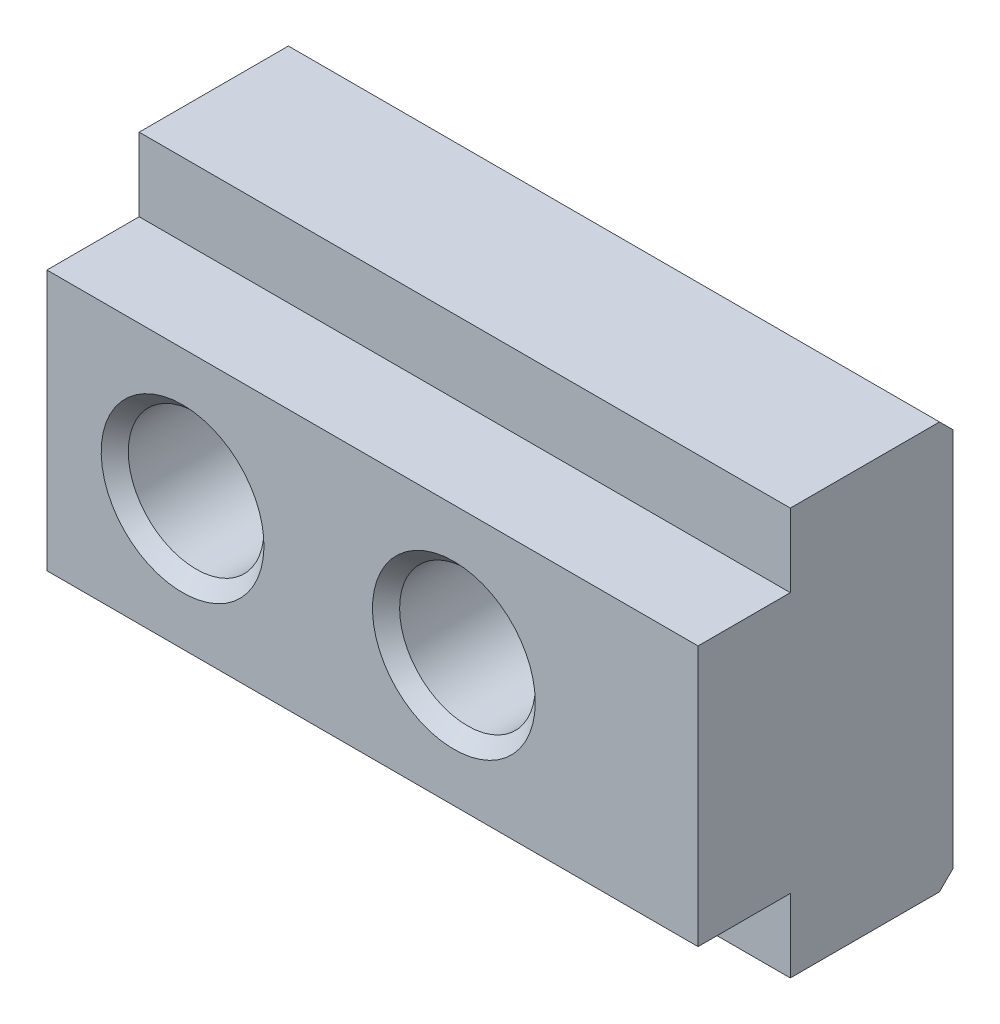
ISO-10303-21;
HEADER;
FILE_DESCRIPTION(('STEP AP214'),'2;1');
FILE_NAME('part.step','',(''),(''),'','','');
FILE_SCHEMA(('AUTOMOTIVE_DESIGN { 1 0 10303 214 1 1 1 1 }'));
ENDSEC;
DATA;
#1=APPLICATION_CONTEXT('core data for automotive mechanical design processes');
#2=APPLICATION_PROTOCOL_DEFINITION('international standard','automotive_design',2000,#1);
#3=PRODUCT_CONTEXT('',#1,'mechanical');
#4=PRODUCT('Part','Part','',(#3));
#5=PRODUCT_RELATED_PRODUCT_CATEGORY('part','',(#4));
#6=PRODUCT_DEFINITION_FORMATION('','',#4);
#7=PRODUCT_DEFINITION_CONTEXT('part definition',#1,'design');
#8=PRODUCT_DEFINITION('design','',#6,#7);
#9=PRODUCT_DEFINITION_SHAPE('','',#8);
#10=(LENGTH_UNIT() NAMED_UNIT(*) SI_UNIT(.MILLI.,.METRE.));
#11=(NAMED_UNIT(*) PLANE_ANGLE_UNIT() SI_UNIT($,.RADIAN.));
#12=(NAMED_UNIT(*) SI_UNIT($,.STERADIAN.) SOLID_ANGLE_UNIT());
#13=UNCERTAINTY_MEASURE_WITH_UNIT(LENGTH_MEASURE(1.E-05),#10,'distance_accuracy_value','');
#14=(GEOMETRIC_REPRESENTATION_CONTEXT(3) GLOBAL_UNCERTAINTY_ASSIGNED_CONTEXT((#13)) GLOBAL_UNIT_ASSIGNED_CONTEXT((#10,
#11,#12)) REPRESENTATION_CONTEXT('',''));
#15=CARTESIAN_POINT('',(0.,0.,0.));
#16=DIRECTION('',(0.,0.,1.));
#17=DIRECTION('',(1.,0.,0.));
#18=AXIS2_PLACEMENT_3D('',#15,#16,#17);
#19=CARTESIAN_POINT('',(-5.,7.5,0.));
#20=DIRECTION('',(0.,-1.,0.));
#21=DIRECTION('',(-1.,0.,0.));
#22=AXIS2_PLACEMENT_3D('',#19,#20,#21);
#23=PLANE('',#22);
#24=DIRECTION('',(-1.,0.,0.));
#25=VECTOR('',#24,1.);
#26=CARTESIAN_POINT('',(-5.,7.5,0.));
#27=LINE('',#26,#25);
#28=CARTESIAN_POINT('',(-5.,7.5,0.));
#29=VERTEX_POINT('',#28);
#30=CARTESIAN_POINT('',(19.,7.5,0.));
#31=VERTEX_POINT('',#30);
#32=EDGE_CURVE('E62',#29,#31,#27,.F.);
#33=ORIENTED_EDGE('',*,*,#32,.T.);
#34=DIRECTION('',(0.,0.,1.));
#35=VECTOR('',#34,1.);
#36=CARTESIAN_POINT('',(19.,7.5,-5.5));
#37=LINE('',#36,#35);
#38=CARTESIAN_POINT('',(19.,7.5,-5.5));
#39=VERTEX_POINT('',#38);
#40=EDGE_CURVE('E137',#39,#31,#37,.T.);
#41=ORIENTED_EDGE('',*,*,#40,.F.);
#42=DIRECTION('',(-1.,0.,0.));
#43=VECTOR('',#42,1.);
#44=CARTESIAN_POINT('',(-5.,7.5,-5.5));
#45=LINE('',#44,#43);
#46=CARTESIAN_POINT('',(-5.,7.5,-5.5));
#47=VERTEX_POINT('',#46);
#48=EDGE_CURVE('E175',#39,#47,#45,.T.);
#49=ORIENTED_EDGE('',*,*,#48,.T.);
#50=DIRECTION('',(0.,0.,-1.));
#51=VECTOR('',#50,1.);
#52=CARTESIAN_POINT('',(-5.,7.5,3.4));
#53=LINE('',#52,#51);
#54=EDGE_CURVE('E172',#29,#47,#53,.T.);
#55=ORIENTED_EDGE('',*,*,#54,.F.);
#56=EDGE_LOOP('',(#33,#41,#49,#55));
#57=FACE_BOUND('',#56,.T.);
#58=ADVANCED_FACE('F14',(#57),#23,.F.);
#59=CARTESIAN_POINT('',(-5.,-7.5,0.));
#60=DIRECTION('',(0.,1.,0.));
#61=DIRECTION('',(1.,0.,0.));
#62=AXIS2_PLACEMENT_3D('',#59,#60,#61);
#63=PLANE('',#62);
#64=DIRECTION('',(-1.,0.,0.));
#65=VECTOR('',#64,1.);
#66=CARTESIAN_POINT('',(-5.,-7.5,-5.5));
#67=LINE('',#66,#65);
#68=CARTESIAN_POINT('',(-5.,-7.5,-5.5));
#69=VERTEX_POINT('',#68);
#70=CARTESIAN_POINT('',(19.,-7.5,-5.5));
#71=VERTEX_POINT('',#70);
#72=EDGE_CURVE('E177',#69,#71,#67,.F.);
#73=ORIENTED_EDGE('',*,*,#72,.T.);
#74=DIRECTION('',(0.,0.,-1.));
#75=VECTOR('',#74,1.);
#76=CARTESIAN_POINT('',(19.,-7.5,0.));
#77=LINE('',#76,#75);
#78=CARTESIAN_POINT('',(19.,-7.5,0.));
#79=VERTEX_POINT('',#78);
#80=EDGE_CURVE('E121',#79,#71,#77,.T.);
#81=ORIENTED_EDGE('',*,*,#80,.F.);
#82=DIRECTION('',(-1.,0.,0.));
#83=VECTOR('',#82,1.);
#84=CARTESIAN_POINT('',(-5.,-7.5,0.));
#85=LINE('',#84,#83);
#86=CARTESIAN_POINT('',(-5.,-7.5,0.));
#87=VERTEX_POINT('',#86);
#88=EDGE_CURVE('E113',#79,#87,#85,.T.);
#89=ORIENTED_EDGE('',*,*,#88,.T.);
#90=DIRECTION('',(0.,0.,-1.));
#91=VECTOR('',#90,1.);
#92=CARTESIAN_POINT('',(-5.,-7.5,3.4));
#93=LINE('',#92,#91);
#94=EDGE_CURVE('E164',#69,#87,#93,.F.);
#95=ORIENTED_EDGE('',*,*,#94,.F.);
#96=EDGE_LOOP('',(#73,#81,#89,#95));
#97=FACE_BOUND('',#96,.T.);
#98=ADVANCED_FACE('F261',(#97),#63,.F.);
#99=CARTESIAN_POINT('',(-5.,-4.8,0.));
#100=DIRECTION('',(0.,0.,-1.));
#101=DIRECTION('',(-1.,0.,0.));
#102=AXIS2_PLACEMENT_3D('',#99,#100,#101);
#103=PLANE('',#102);
#104=ORIENTED_EDGE('',*,*,#88,.F.);
#105=DIRECTION('',(0.,-1.,0.));
#106=VECTOR('',#105,1.);
#107=CARTESIAN_POINT('',(19.,-4.8,0.));
#108=LINE('',#107,#106);
#109=CARTESIAN_POINT('',(19.,-4.8,0.));
#110=VERTEX_POINT('',#109);
#111=EDGE_CURVE('E116',#110,#79,#108,.T.);
#112=ORIENTED_EDGE('',*,*,#111,.F.);
#113=DIRECTION('',(1.,0.,0.));
#114=VECTOR('',#113,1.);
#115=CARTESIAN_POINT('',(-5.,-4.8,0.));
#116=LINE('',#115,#114);
#117=CARTESIAN_POINT('',(-5.,-4.8,0.));
#118=VERTEX_POINT('',#117);
#119=EDGE_CURVE('E103',#110,#118,#116,.F.);
#120=ORIENTED_EDGE('',*,*,#119,.T.);
#121=DIRECTION('',(0.,1.,0.));
#122=VECTOR('',#121,1.);
#123=CARTESIAN_POINT('',(-5.,-4.8,0.));
#124=LINE('',#123,#122);
#125=EDGE_CURVE('E162',#87,#118,#124,.T.);
#126=ORIENTED_EDGE('',*,*,#125,.F.);
#127=EDGE_LOOP('',(#104,#112,#120,#126));
#128=FACE_BOUND('',#127,.T.);
#129=ADVANCED_FACE('F117',(#128),#103,.F.);
#130=CARTESIAN_POINT('',(-5.,-4.8,3.4));
#131=DIRECTION('',(0.,1.,0.));
#132=DIRECTION('',(1.,0.,0.));
#133=AXIS2_PLACEMENT_3D('',#130,#131,#132);
#134=PLANE('',#133);
#135=ORIENTED_EDGE('',*,*,#119,.F.);
#136=DIRECTION('',(0.,0.,-1.));
#137=VECTOR('',#136,1.);
#138=CARTESIAN_POINT('',(19.,-4.8,3.4));
#139=LINE('',#138,#137);
#140=CARTESIAN_POINT('',(19.,-4.8,3.4));
#141=VERTEX_POINT('',#140);
#142=EDGE_CURVE('E107',#141,#110,#139,.T.);
#143=ORIENTED_EDGE('',*,*,#142,.F.);
#144=DIRECTION('',(-1.,0.,0.));
#145=VECTOR('',#144,1.);
#146=CARTESIAN_POINT('',(-5.,-4.8,3.4));
#147=LINE('',#146,#145);
#148=CARTESIAN_POINT('',(-5.,-4.8,3.4));
#149=VERTEX_POINT('',#148);
#150=EDGE_CURVE('E70',#141,#149,#147,.T.);
#151=ORIENTED_EDGE('',*,*,#150,.T.);
#152=DIRECTION('',(0.,0.,-1.));
#153=VECTOR('',#152,1.);
#154=CARTESIAN_POINT('',(-5.,-4.8,3.4));
#155=LINE('',#154,#153);
#156=EDGE_CURVE('E109',#118,#149,#155,.F.);
#157=ORIENTED_EDGE('',*,*,#156,.F.);
#158=EDGE_LOOP('',(#135,#143,#151,#157));
#159=FACE_BOUND('',#158,.T.);
#160=ADVANCED_FACE('F105',(#159),#134,.F.);
#161=CARTESIAN_POINT('',(-5.,-4.8,3.4));
#162=DIRECTION('',(0.,0.,-1.));
#163=DIRECTION('',(-1.,0.,0.));
#164=AXIS2_PLACEMENT_3D('',#161,#162,#163);
#165=PLANE('',#164);
#166=CARTESIAN_POINT('',(10.,0.,3.4));
#167=DIRECTION('',(0.,0.,-1.));
#168=DIRECTION('',(0.,1.,0.));
#169=AXIS2_PLACEMENT_3D('',#166,#167,#168);
#170=CIRCLE('',#169,3.);
#171=CARTESIAN_POINT('',(10.,3.,3.4));
#172=VERTEX_POINT('',#171);
#173=EDGE_CURVE('E199',#172,#172,#170,.T.);
#174=ORIENTED_EDGE('',*,*,#173,.T.);
#175=EDGE_LOOP('',(#174));
#176=FACE_BOUND('',#175,.T.);
#177=CARTESIAN_POINT('',(0.,0.,3.4));
#178=DIRECTION('',(0.,0.,-1.));
#179=DIRECTION('',(0.,1.,0.));
#180=AXIS2_PLACEMENT_3D('',#177,#178,#179);
#181=CIRCLE('',#180,2.99999999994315);
#182=CARTESIAN_POINT('',(0.,2.99999999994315,3.4));
#183=VERTEX_POINT('',#182);
#184=EDGE_CURVE('E196',#183,#183,#181,.T.);
#185=ORIENTED_EDGE('',*,*,#184,.T.);
#186=EDGE_LOOP('',(#185));
#187=FACE_BOUND('',#186,.T.);
#188=ORIENTED_EDGE('',*,*,#150,.F.);
#189=DIRECTION('',(0.,-1.,0.));
#190=VECTOR('',#189,1.);
#191=CARTESIAN_POINT('',(19.,4.8,3.4));
#192=LINE('',#191,#190);
#193=CARTESIAN_POINT('',(19.,4.8,3.4));
#194=VERTEX_POINT('',#193);
#195=EDGE_CURVE('E124',#194,#141,#192,.T.);
#196=ORIENTED_EDGE('',*,*,#195,.F.);
#197=DIRECTION('',(-1.,0.,0.));
#198=VECTOR('',#197,1.);
#199=CARTESIAN_POINT('',(-5.,4.8,3.4));
#200=LINE('',#199,#198);
#201=CARTESIAN_POINT('',(-5.,4.8,3.4));
#202=VERTEX_POINT('',#201);
#203=EDGE_CURVE('E77',#194,#202,#200,.T.);
#204=ORIENTED_EDGE('',*,*,#203,.T.);
#205=DIRECTION('',(0.,1.,0.));
#206=VECTOR('',#205,1.);
#207=CARTESIAN_POINT('',(-5.,-4.8,3.4));
#208=LINE('',#207,#206);
#209=EDGE_CURVE('E158',#149,#202,#208,.T.);
#210=ORIENTED_EDGE('',*,*,#209,.F.);
#211=EDGE_LOOP('',(#188,#196,#204,#210));
#212=FACE_BOUND('',#211,.T.);
#213=ADVANCED_FACE('F211',(#176,#187,#212),#165,.F.);
#214=CARTESIAN_POINT('',(-5.,4.8,3.4));
#215=DIRECTION('',(0.,-1.,0.));
#216=DIRECTION('',(-1.,0.,0.));
#217=AXIS2_PLACEMENT_3D('',#214,#215,#216);
#218=PLANE('',#217);
#219=ORIENTED_EDGE('',*,*,#203,.F.);
#220=DIRECTION('',(0.,0.,1.));
#221=VECTOR('',#220,1.);
#222=CARTESIAN_POINT('',(19.,4.8,0.));
#223=LINE('',#222,#221);
#224=CARTESIAN_POINT('',(19.,4.8,0.));
#225=VERTEX_POINT('',#224);
#226=EDGE_CURVE('E143',#225,#194,#223,.T.);
#227=ORIENTED_EDGE('',*,*,#226,.F.);
#228=DIRECTION('',(-1.,0.,0.));
#229=VECTOR('',#228,1.);
#230=CARTESIAN_POINT('',(-5.,4.8,0.));
#231=LINE('',#230,#229);
#232=CARTESIAN_POINT('',(-5.,4.8,0.));
#233=VERTEX_POINT('',#232);
#234=EDGE_CURVE('E180',#225,#233,#231,.T.);
#235=ORIENTED_EDGE('',*,*,#234,.T.);
#236=DIRECTION('',(0.,0.,-1.));
#237=VECTOR('',#236,1.);
#238=CARTESIAN_POINT('',(-5.,4.8,3.4));
#239=LINE('',#238,#237);
#240=EDGE_CURVE('E155',#202,#233,#239,.T.);
#241=ORIENTED_EDGE('',*,*,#240,.F.);
#242=EDGE_LOOP('',(#219,#227,#235,#241));
#243=FACE_BOUND('',#242,.T.);
#244=ADVANCED_FACE('F213',(#243),#218,.F.);
#245=CARTESIAN_POINT('',(-5.,7.5,0.));
#246=DIRECTION('',(0.,0.,-1.));
#247=DIRECTION('',(0.,-1.,0.));
#248=AXIS2_PLACEMENT_3D('',#245,#246,#247);
#249=PLANE('',#248);
#250=ORIENTED_EDGE('',*,*,#234,.F.);
#251=DIRECTION('',(0.,-1.,0.));
#252=VECTOR('',#251,1.);
#253=CARTESIAN_POINT('',(19.,7.5,0.));
#254=LINE('',#253,#252);
#255=EDGE_CURVE('E140',#31,#225,#254,.T.);
#256=ORIENTED_EDGE('',*,*,#255,.F.);
#257=ORIENTED_EDGE('',*,*,#32,.F.);
#258=DIRECTION('',(0.,1.,0.));
#259=VECTOR('',#258,1.);
#260=CARTESIAN_POINT('',(-5.,-4.8,0.));
#261=LINE('',#260,#259);
#262=EDGE_CURVE('E153',#233,#29,#261,.T.);
#263=ORIENTED_EDGE('',*,*,#262,.F.);
#264=EDGE_LOOP('',(#250,#256,#257,#263));
#265=FACE_BOUND('',#264,.T.);
#266=ADVANCED_FACE('F222',(#265),#249,.F.);
#267=CARTESIAN_POINT('',(-5.,-7.5,-5.5));
#268=DIRECTION('',(0.,0.707106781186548,0.707106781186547));
#269=DIRECTION('',(0.,0.707106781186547,-0.707106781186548));
#270=AXIS2_PLACEMENT_3D('',#267,#268,#269);
#271=PLANE('',#270);
#272=DIRECTION('',(-1.,0.,0.));
#273=VECTOR('',#272,1.);
#274=CARTESIAN_POINT('',(-5.,-7.,-6.));
#275=LINE('',#274,#273);
#276=CARTESIAN_POINT('',(-5.,-7.,-6.));
#277=VERTEX_POINT('',#276);
#278=CARTESIAN_POINT('',(19.,-7.,-6.));
#279=VERTEX_POINT('',#278);
#280=EDGE_CURVE('E151',#277,#279,#275,.F.);
#281=ORIENTED_EDGE('',*,*,#280,.T.);
#282=DIRECTION('',(0.,0.707106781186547,-0.707106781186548));
#283=VECTOR('',#282,1.);
#284=CARTESIAN_POINT('',(19.,-7.5,-5.5));
#285=LINE('',#284,#283);
#286=EDGE_CURVE('E128',#71,#279,#285,.T.);
#287=ORIENTED_EDGE('',*,*,#286,.F.);
#288=ORIENTED_EDGE('',*,*,#72,.F.);
#289=DIRECTION('',(0.,-0.707106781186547,0.707106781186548));
#290=VECTOR('',#289,1.);
#291=CARTESIAN_POINT('',(-5.,-7.,-6.));
#292=LINE('',#291,#290);
#293=EDGE_CURVE('E167',#277,#69,#292,.T.);
#294=ORIENTED_EDGE('',*,*,#293,.F.);
#295=EDGE_LOOP('',(#281,#287,#288,#294));
#296=FACE_BOUND('',#295,.T.);
#297=ADVANCED_FACE('F246',(#296),#271,.F.);
#298=CARTESIAN_POINT('',(-5.,7.,-6.));
#299=DIRECTION('',(0.,-0.707106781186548,0.707106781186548));
#300=DIRECTION('',(0.,0.707106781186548,0.707106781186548));
#301=AXIS2_PLACEMENT_3D('',#298,#299,#300);
#302=PLANE('',#301);
#303=ORIENTED_EDGE('',*,*,#48,.F.);
#304=DIRECTION('',(0.,0.707106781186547,0.707106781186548));
#305=VECTOR('',#304,1.);
#306=CARTESIAN_POINT('',(19.,7.,-6.));
#307=LINE('',#306,#305);
#308=CARTESIAN_POINT('',(19.,7.,-6.));
#309=VERTEX_POINT('',#308);
#310=EDGE_CURVE('E134',#309,#39,#307,.T.);
#311=ORIENTED_EDGE('',*,*,#310,.F.);
#312=DIRECTION('',(-1.,0.,0.));
#313=VECTOR('',#312,1.);
#314=CARTESIAN_POINT('',(-5.,7.,-6.));
#315=LINE('',#314,#313);
#316=CARTESIAN_POINT('',(-5.,7.,-6.));
#317=VERTEX_POINT('',#316);
#318=EDGE_CURVE('E31',#309,#317,#315,.T.);
#319=ORIENTED_EDGE('',*,*,#318,.T.);
#320=DIRECTION('',(0.,-0.707106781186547,-0.707106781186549));
#321=VECTOR('',#320,1.);
#322=CARTESIAN_POINT('',(-5.,7.5,-5.5));
#323=LINE('',#322,#321);
#324=EDGE_CURVE('E170',#47,#317,#323,.T.);
#325=ORIENTED_EDGE('',*,*,#324,.F.);
#326=EDGE_LOOP('',(#303,#311,#319,#325));
#327=FACE_BOUND('',#326,.T.);
#328=ADVANCED_FACE('F238',(#327),#302,.F.);
#329=CARTESIAN_POINT('',(-5.,-4.8,3.4));
#330=DIRECTION('',(-1.,0.,0.));
#331=DIRECTION('',(0.,1.,0.));
#332=AXIS2_PLACEMENT_3D('',#329,#330,#331);
#333=PLANE('',#332);
#334=ORIENTED_EDGE('',*,*,#240,.T.);
#335=ORIENTED_EDGE('',*,*,#262,.T.);
#336=ORIENTED_EDGE('',*,*,#54,.T.);
#337=ORIENTED_EDGE('',*,*,#324,.T.);
#338=DIRECTION('',(0.,1.,0.));
#339=VECTOR('',#338,1.);
#340=CARTESIAN_POINT('',(-5.,7.5,-6.));
#341=LINE('',#340,#339);
#342=EDGE_CURVE('E146',#317,#277,#341,.F.);
#343=ORIENTED_EDGE('',*,*,#342,.T.);
#344=ORIENTED_EDGE('',*,*,#293,.T.);
#345=ORIENTED_EDGE('',*,*,#94,.T.);
#346=ORIENTED_EDGE('',*,*,#125,.T.);
#347=ORIENTED_EDGE('',*,*,#156,.T.);
#348=ORIENTED_EDGE('',*,*,#209,.T.);
#349=EDGE_LOOP('',(#334,#335,#336,#337,#343,#344,#345,#346,#347,#348));
#350=FACE_BOUND('',#349,.T.);
#351=ADVANCED_FACE('F227',(#350),#333,.T.);
#352=CARTESIAN_POINT('',(-5.,7.5,-6.));
#353=DIRECTION('',(0.,0.,1.));
#354=DIRECTION('',(0.,1.,0.));
#355=AXIS2_PLACEMENT_3D('',#352,#353,#354);
#356=PLANE('',#355);
#357=CARTESIAN_POINT('',(10.,0.,-6.));
#358=DIRECTION('',(0.,0.,1.));
#359=DIRECTION('',(0.,-1.,0.));
#360=AXIS2_PLACEMENT_3D('',#357,#358,#359);
#361=CIRCLE('',#360,3.);
#362=CARTESIAN_POINT('',(10.,-3.,-6.));
#363=VERTEX_POINT('',#362);
#364=EDGE_CURVE('E187',#363,#363,#361,.T.);
#365=ORIENTED_EDGE('',*,*,#364,.T.);
#366=EDGE_LOOP('',(#365));
#367=FACE_BOUND('',#366,.T.);
#368=CARTESIAN_POINT('',(0.,0.,-6.));
#369=DIRECTION('',(0.,0.,1.));
#370=DIRECTION('',(0.,-1.,0.));
#371=AXIS2_PLACEMENT_3D('',#368,#369,#370);
#372=CIRCLE('',#371,3.);
#373=CARTESIAN_POINT('',(0.,-3.,-6.));
#374=VERTEX_POINT('',#373);
#375=EDGE_CURVE('E149',#374,#374,#372,.T.);
#376=ORIENTED_EDGE('',*,*,#375,.T.);
#377=EDGE_LOOP('',(#376));
#378=FACE_BOUND('',#377,.T.);
#379=ORIENTED_EDGE('',*,*,#318,.F.);
#380=DIRECTION('',(0.,1.,0.));
#381=VECTOR('',#380,1.);
#382=CARTESIAN_POINT('',(19.,-7.,-6.));
#383=LINE('',#382,#381);
#384=EDGE_CURVE('E131',#279,#309,#383,.T.);
#385=ORIENTED_EDGE('',*,*,#384,.F.);
#386=ORIENTED_EDGE('',*,*,#280,.F.);
#387=ORIENTED_EDGE('',*,*,#342,.F.);
#388=EDGE_LOOP('',(#379,#385,#386,#387));
#389=FACE_BOUND('',#388,.T.);
#390=ADVANCED_FACE('F225',(#367,#378,#389),#356,.F.);
#391=CARTESIAN_POINT('',(0.,0.,3.40000000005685));
#392=DIRECTION('',(0.,0.,-1.));
#393=DIRECTION('',(0.,-1.,0.));
#394=AXIS2_PLACEMENT_3D('',#391,#392,#393);
#395=CYLINDRICAL_SURFACE('',#394,2.5);
#396=CARTESIAN_POINT('',(0.,0.,-5.5));
#397=DIRECTION('',(0.,0.,1.));
#398=DIRECTION('',(0.,-1.,0.));
#399=AXIS2_PLACEMENT_3D('',#396,#397,#398);
#400=CIRCLE('',#399,2.5);
#401=CARTESIAN_POINT('',(0.,-2.5,-5.5));
#402=VERTEX_POINT('',#401);
#403=EDGE_CURVE('E9',#402,#402,#400,.F.);
#404=ORIENTED_EDGE('',*,*,#403,.T.);
#405=EDGE_LOOP('',(#404));
#406=FACE_BOUND('',#405,.T.);
#407=CARTESIAN_POINT('',(0.,0.,2.90000000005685));
#408=DIRECTION('',(0.,0.,-1.));
#409=DIRECTION('',(0.,1.,0.));
#410=AXIS2_PLACEMENT_3D('',#407,#408,#409);
#411=CIRCLE('',#410,2.5);
#412=CARTESIAN_POINT('',(0.,2.5,2.90000000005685));
#413=VERTEX_POINT('',#412);
#414=EDGE_CURVE('E23',#413,#413,#411,.F.);
#415=ORIENTED_EDGE('',*,*,#414,.T.);
#416=EDGE_LOOP('',(#415));
#417=FACE_BOUND('',#416,.T.);
#418=ADVANCED_FACE('F204',(#406,#417),#395,.F.);
#419=CARTESIAN_POINT('',(10.,0.,-6.6));
#420=DIRECTION('',(0.,0.,1.));
#421=DIRECTION('',(1.,0.,0.));
#422=AXIS2_PLACEMENT_3D('',#419,#420,#421);
#423=CYLINDRICAL_SURFACE('',#422,2.5);
#424=CARTESIAN_POINT('',(10.,0.,-5.5));
#425=DIRECTION('',(0.,0.,1.));
#426=DIRECTION('',(1.,0.,0.));
#427=AXIS2_PLACEMENT_3D('',#424,#425,#426);
#428=CIRCLE('',#427,2.5);
#429=CARTESIAN_POINT('',(12.5,0.,-5.5));
#430=VERTEX_POINT('',#429);
#431=EDGE_CURVE('E193',#430,#430,#428,.F.);
#432=ORIENTED_EDGE('',*,*,#431,.T.);
#433=EDGE_LOOP('',(#432));
#434=FACE_BOUND('',#433,.T.);
#435=CARTESIAN_POINT('',(10.,0.,2.9));
#436=DIRECTION('',(0.,0.,-1.));
#437=DIRECTION('',(-1.,0.,0.));
#438=AXIS2_PLACEMENT_3D('',#435,#436,#437);
#439=CIRCLE('',#438,2.5);
#440=CARTESIAN_POINT('',(7.5,0.,2.9));
#441=VERTEX_POINT('',#440);
#442=EDGE_CURVE('E190',#441,#441,#439,.F.);
#443=ORIENTED_EDGE('',*,*,#442,.T.);
#444=EDGE_LOOP('',(#443));
#445=FACE_BOUND('',#444,.T.);
#446=ADVANCED_FACE('F235',(#434,#445),#423,.F.);
#447=CARTESIAN_POINT('',(10.,0.,-6.));
#448=DIRECTION('',(0.,0.,-1.));
#449=DIRECTION('',(-1.,0.,0.));
#450=AXIS2_PLACEMENT_3D('',#447,#448,#449);
#451=CONICAL_SURFACE('',#450,3.,0.78539816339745);
#452=ORIENTED_EDGE('',*,*,#431,.F.);
#453=EDGE_LOOP('',(#452));
#454=FACE_BOUND('',#453,.T.);
#455=ORIENTED_EDGE('',*,*,#364,.F.);
#456=EDGE_LOOP('',(#455));
#457=FACE_BOUND('',#456,.T.);
#458=ADVANCED_FACE('F275',(#454,#457),#451,.F.);
#459=CARTESIAN_POINT('',(10.,0.,2.9));
#460=DIRECTION('',(0.,0.,1.));
#461=DIRECTION('',(1.,0.,0.));
#462=AXIS2_PLACEMENT_3D('',#459,#460,#461);
#463=CONICAL_SURFACE('',#462,2.5,0.785398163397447);
#464=ORIENTED_EDGE('',*,*,#173,.F.);
#465=EDGE_LOOP('',(#464));
#466=FACE_BOUND('',#465,.T.);
#467=ORIENTED_EDGE('',*,*,#442,.F.);
#468=EDGE_LOOP('',(#467));
#469=FACE_BOUND('',#468,.T.);
#470=ADVANCED_FACE('F278',(#466,#469),#463,.F.);
#471=CARTESIAN_POINT('',(0.,0.,-5.5));
#472=DIRECTION('',(0.,0.,-1.));
#473=DIRECTION('',(0.,1.,0.));
#474=AXIS2_PLACEMENT_3D('',#471,#472,#473);
#475=CONICAL_SURFACE('',#474,2.5,0.785398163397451);
#476=ORIENTED_EDGE('',*,*,#375,.F.);
#477=EDGE_LOOP('',(#476));
#478=FACE_BOUND('',#477,.T.);
#479=ORIENTED_EDGE('',*,*,#403,.F.);
#480=EDGE_LOOP('',(#479));
#481=FACE_BOUND('',#480,.T.);
#482=ADVANCED_FACE('F208',(#478,#481),#475,.F.);
#483=CARTESIAN_POINT('',(0.,0.,3.4));
#484=DIRECTION('',(0.,0.,1.));
#485=DIRECTION('',(0.,-1.,0.));
#486=AXIS2_PLACEMENT_3D('',#483,#484,#485);
#487=CONICAL_SURFACE('',#486,2.99999999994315,0.785398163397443);
#488=ORIENTED_EDGE('',*,*,#414,.F.);
#489=EDGE_LOOP('',(#488));
#490=FACE_BOUND('',#489,.T.);
#491=ORIENTED_EDGE('',*,*,#184,.F.);
#492=EDGE_LOOP('',(#491));
#493=FACE_BOUND('',#492,.T.);
#494=ADVANCED_FACE('F16',(#490,#493),#487,.F.);
#495=CARTESIAN_POINT('',(19.,0.,0.));
#496=DIRECTION('',(-1.,0.,0.));
#497=DIRECTION('',(0.,0.,1.));
#498=AXIS2_PLACEMENT_3D('',#495,#496,#497);
#499=PLANE('',#498);
#500=ORIENTED_EDGE('',*,*,#142,.T.);
#501=ORIENTED_EDGE('',*,*,#111,.T.);
#502=ORIENTED_EDGE('',*,*,#80,.T.);
#503=ORIENTED_EDGE('',*,*,#286,.T.);
#504=ORIENTED_EDGE('',*,*,#384,.T.);
#505=ORIENTED_EDGE('',*,*,#310,.T.);
#506=ORIENTED_EDGE('',*,*,#40,.T.);
#507=ORIENTED_EDGE('',*,*,#255,.T.);
#508=ORIENTED_EDGE('',*,*,#226,.T.);
#509=ORIENTED_EDGE('',*,*,#195,.T.);
#510=EDGE_LOOP('',(#500,#501,#502,#503,#504,#505,#506,#507,#508,#509));
#511=FACE_BOUND('',#510,.T.);
#512=ADVANCED_FACE('F123',(#511),#499,.F.);
#513=CLOSED_SHELL('',(#58,#98,#129,#160,#213,#244,#266,#297,#328,#351,#390,#418,#446,#458,#470,
#482,#494,#512));
#514=MANIFOLD_SOLID_BREP('B1',#513);
#515=ADVANCED_BREP_SHAPE_REPRESENTATION('',(#18,#514),#14);
#516=SHAPE_DEFINITION_REPRESENTATION(#9,#515);
ENDSEC;
END-ISO-10303-21;
